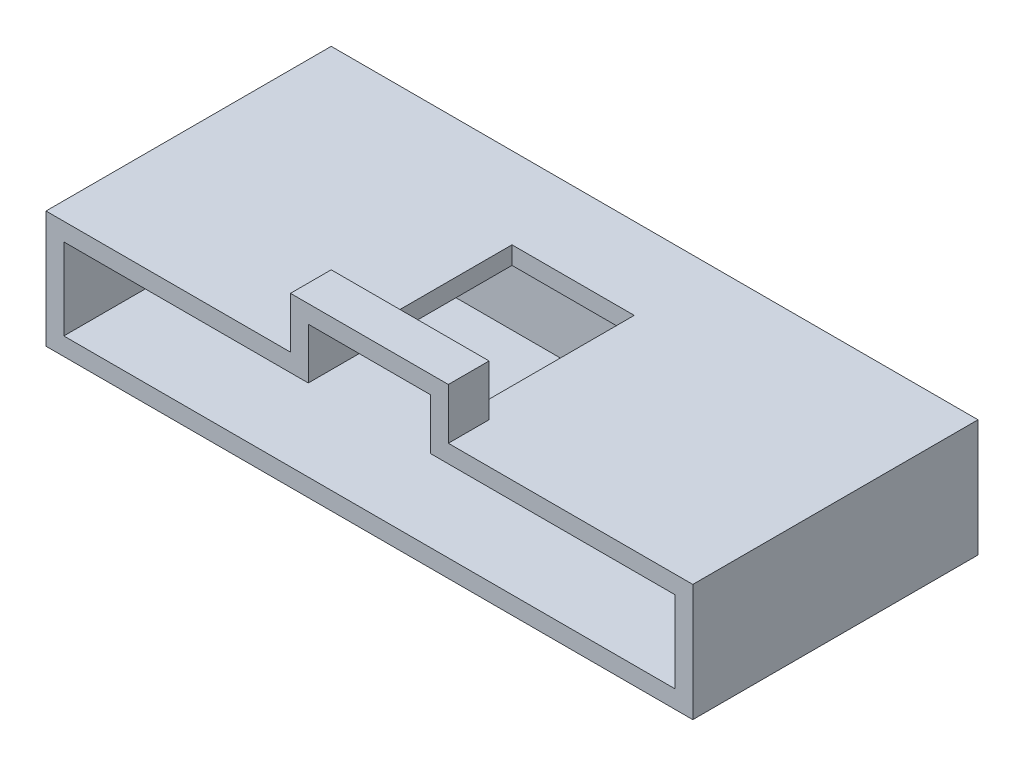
from build123d import *

# Parameters (mm, degrees)
SKETCH1_W           = 25.4
SKETCH1_H           = 4.6
BOSS_EXTRUDE1_DEPTH = 11.2
SKETCH2_W           = 24
SKETCH2_H           = 3.2
CUT_EXTRUDE1_DEPTH  = 9
SKETCH3_W           = 6.2
SKETCH3_H           = 2.7
BOSS_EXTRUDE2_DEPTH = 1.6
SKETCH4_W           = 4.8
SKETCH4_H           = 2
CUT_EXTRUDE2_DEPTH  = 8


with BuildPart() as part:
    # Sketch1 → Boss-Extrude1 (new body)
    with BuildSketch(Plane.XY):
        with Locations((12.7, 2.3)):
            Rectangle(SKETCH1_W, SKETCH1_H)
    extrude(amount=BOSS_EXTRUDE1_DEPTH)

    # Sketch2 → Cut-Extrude1 (cut)
    with BuildSketch(Plane.XY.offset(11.2)):
        with Locations((12.7, 2.3)):
            Rectangle(SKETCH2_W, SKETCH2_H)
    extrude(amount=-CUT_EXTRUDE1_DEPTH, mode=Mode.SUBTRACT)

    # Sketch3 → Boss-Extrude2 (add)
    with BuildSketch(Plane.XY.offset(11.2)):
        with Locations((12.7, 5.25)):
            Rectangle(SKETCH3_W, SKETCH3_H)
    extrude(amount=-BOSS_EXTRUDE2_DEPTH)

    # Sketch4 → Cut-Extrude2 (cut)
    with BuildSketch(Plane.XY.offset(11.2)):
        with Locations((12.7, 4.9)):
            Rectangle(SKETCH4_W, SKETCH4_H)
    extrude(amount=-CUT_EXTRUDE2_DEPTH, mode=Mode.SUBTRACT)


solid = part.part
